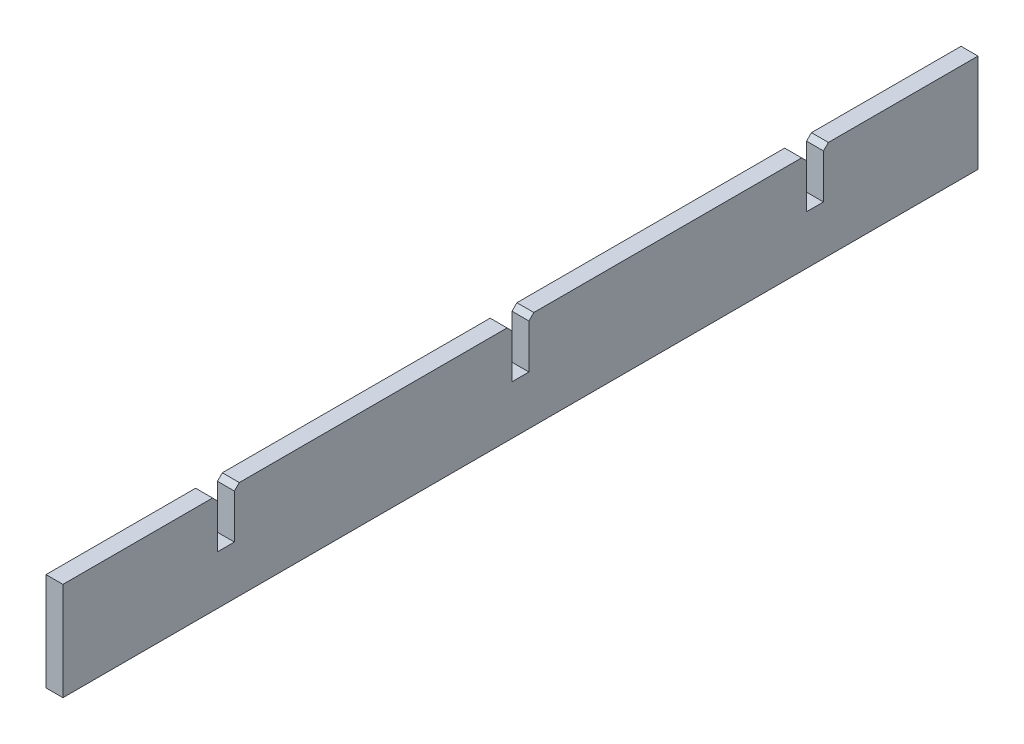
from build123d import *

# Parameters (mm, degrees)
SKETCH1_W                      = 932
SKETCH1_H                      = 100
SUPPORT_DEPTH                  = 17.25
CUT_EXTRUDE2_START             = 17.25
SKETCH3_W                      = 8.625
SKETCH3_H                      = 50
CUT_EXTRUDE2_DEPTH             = 18
CHAMFER1_SIZE                  = 5
LPATTERN2_COUNT                = 2
LPATTERN2_PITCH                = 300
LPATTERN2_START                = 17.25
LPATTERN2_COPY_1_SKETCH_W      = 8.625
LPATTERN2_COPY_1_SKETCH_H      = 50
LPATTERN2_COPY_1_DEPTH         = 18
CHAMFER1_OF_LPATTERN2_SIZE     = 5
LPATTERN2_COL_COUNT            = 2
LPATTERN2_COL_PITCH            = 300
LPATTERN2_COL_COPY_1_SKETCH_W  = 8.625
LPATTERN2_COL_COPY_1_SKETCH_H  = 50
LPATTERN2_COL_COPY_1_DEPTH     = 18
CHAMFER1_OF_LPATTERN2_COL_SIZE = 5


with BuildPart() as part:
    # Sketch1 → Support (new body)
    with BuildSketch(Plane(origin=(0, 0, 0), x_dir=(0, 0, -1), z_dir=(1, 0, 0))):
        Rectangle(SKETCH1_W, SKETCH1_H)
    extrude(amount=SUPPORT_DEPTH)

    # Sketch3 → Cut-Extrude2 (cut)
    with BuildSketch(Plane(origin=(0, 0, 0), x_dir=(0, 0, -1), z_dir=(1, 0, 0)).offset(CUT_EXTRUDE2_START)):
        with Locations((-4.3125, 25)):
            Rectangle(SKETCH3_W, SKETCH3_H)
    cut_extrude2 = extrude(amount=-CUT_EXTRUDE2_DEPTH, mode=Mode.SUBTRACT)

    # Mirror1: Cut-Extrude2 across plane
    add(cut_extrude2.mirror(Plane.XY), mode=Mode.SUBTRACT)

    # Chamfer1
    chamfer1_edges = [part.edges().sort_by_distance(p)[0] for p in [
        (8.625, 50, 8.625),
        (8.625, 50, -8.625),
    ]]
    chamfer(chamfer1_edges, length=CHAMFER1_SIZE)

    # LPattern2: Cut-Extrude2 ×2
    with Locations(*[(0, 0, i * LPATTERN2_PITCH) for i in range(1, LPATTERN2_COUNT)]):
        add(cut_extrude2, mode=Mode.SUBTRACT)

    # LPattern2 copy 1 sketch → LPattern2 copy 1 (cut)
    with BuildSketch(Plane(origin=(0, 0, 300), x_dir=(0, 0, 1), z_dir=(1, 0, 0)).offset(LPATTERN2_START)):
        with Locations((-4.3125, -25)):
            Rectangle(LPATTERN2_COPY_1_SKETCH_W, LPATTERN2_COPY_1_SKETCH_H)
    extrude(amount=-LPATTERN2_COPY_1_DEPTH, mode=Mode.SUBTRACT)

    # Chamfer1 of LPattern2
    chamfer1_of_lpattern2_edges = [part.edges().sort_by_distance(p)[0] for p in [
        (8.625, 50, 308.625),
        (8.625, 50, 291.375),
    ]]
    chamfer(chamfer1_of_lpattern2_edges, length=CHAMFER1_OF_LPATTERN2_SIZE)

    # LPattern2 col: Cut-Extrude2 ×2
    with Locations(*[(0, 0, -i * LPATTERN2_COL_PITCH) for i in range(1, LPATTERN2_COL_COUNT)]):
        add(cut_extrude2, mode=Mode.SUBTRACT)

    # LPattern2 col copy 1 sketch → LPattern2 col copy 1 (cut)
    with BuildSketch(Plane(origin=(0, 0, -300), x_dir=(0, 0, 1), z_dir=(1, 0, 0)).offset(LPATTERN2_START)):
        with Locations((-4.3125, -25)):
            Rectangle(LPATTERN2_COL_COPY_1_SKETCH_W, LPATTERN2_COL_COPY_1_SKETCH_H)
    extrude(amount=-LPATTERN2_COL_COPY_1_DEPTH, mode=Mode.SUBTRACT)

    # Chamfer1 of LPattern2 col
    chamfer1_of_lpattern2_col_edges = [part.edges().sort_by_distance(p)[0] for p in [
        (8.625, 50, -291.375),
        (8.625, 50, -308.625),
    ]]
    chamfer(chamfer1_of_lpattern2_col_edges, length=CHAMFER1_OF_LPATTERN2_COL_SIZE)


solid = part.part
